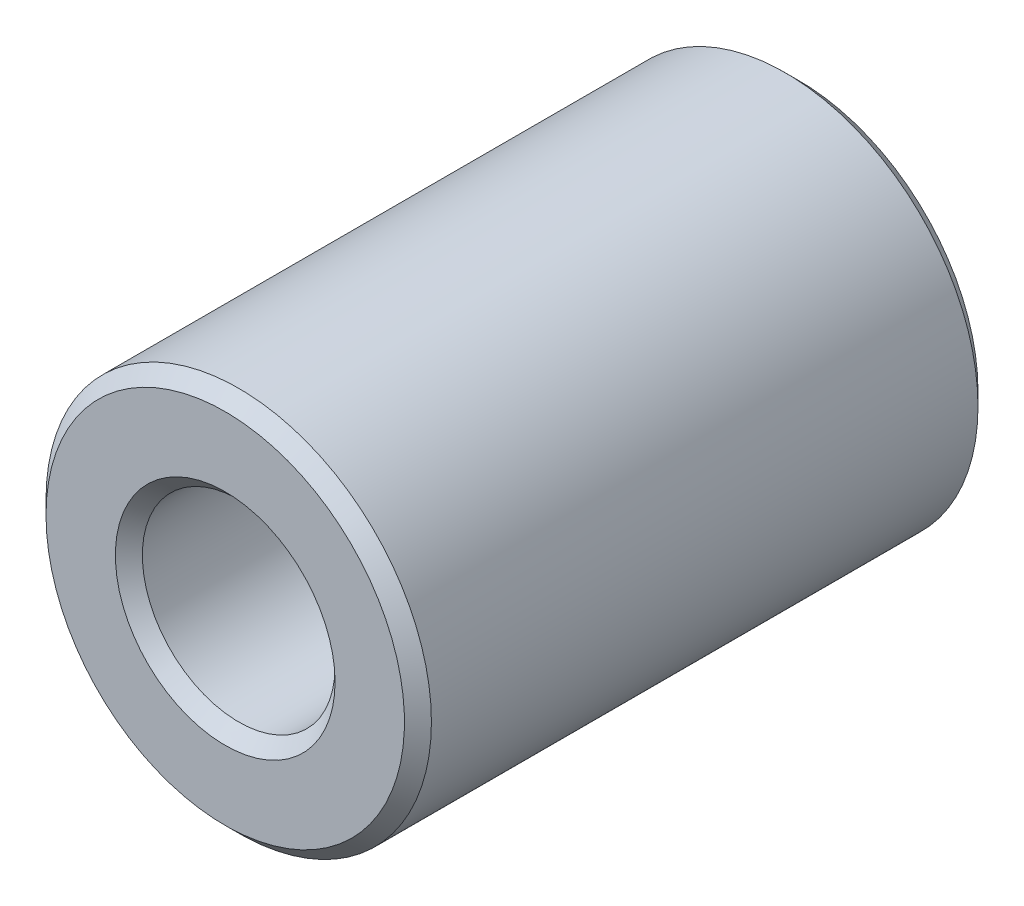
ISO-10303-21;
HEADER;
FILE_DESCRIPTION(('STEP AP214'),'2;1');
FILE_NAME('part.step','',(''),(''),'','','');
FILE_SCHEMA(('AUTOMOTIVE_DESIGN { 1 0 10303 214 1 1 1 1 }'));
ENDSEC;
DATA;
#1=APPLICATION_CONTEXT('core data for automotive mechanical design processes');
#2=APPLICATION_PROTOCOL_DEFINITION('international standard','automotive_design',2000,#1);
#3=PRODUCT_CONTEXT('',#1,'mechanical');
#4=PRODUCT('Part','Part','',(#3));
#5=PRODUCT_RELATED_PRODUCT_CATEGORY('part','',(#4));
#6=PRODUCT_DEFINITION_FORMATION('','',#4);
#7=PRODUCT_DEFINITION_CONTEXT('part definition',#1,'design');
#8=PRODUCT_DEFINITION('design','',#6,#7);
#9=PRODUCT_DEFINITION_SHAPE('','',#8);
#10=(LENGTH_UNIT() NAMED_UNIT(*) SI_UNIT(.MILLI.,.METRE.));
#11=(NAMED_UNIT(*) PLANE_ANGLE_UNIT() SI_UNIT($,.RADIAN.));
#12=(NAMED_UNIT(*) SI_UNIT($,.STERADIAN.) SOLID_ANGLE_UNIT());
#13=UNCERTAINTY_MEASURE_WITH_UNIT(LENGTH_MEASURE(1.E-05),#10,'distance_accuracy_value','');
#14=(GEOMETRIC_REPRESENTATION_CONTEXT(3) GLOBAL_UNCERTAINTY_ASSIGNED_CONTEXT((#13)) GLOBAL_UNIT_ASSIGNED_CONTEXT((#10,
#11,#12)) REPRESENTATION_CONTEXT('',''));
#15=CARTESIAN_POINT('',(0.,0.,0.));
#16=DIRECTION('',(0.,0.,1.));
#17=DIRECTION('',(1.,0.,0.));
#18=AXIS2_PLACEMENT_3D('',#15,#16,#17);
#19=CARTESIAN_POINT('',(0.,0.,-4.7625));
#20=DIRECTION('',(0.,0.,1.));
#21=DIRECTION('',(1.,0.,0.));
#22=AXIS2_PLACEMENT_3D('',#19,#20,#21);
#23=CYLINDRICAL_SURFACE('',#22,3.2004);
#24=CARTESIAN_POINT('',(0.,0.,-4.538472));
#25=DIRECTION('',(0.,0.,1.));
#26=DIRECTION('',(1.,0.,0.));
#27=AXIS2_PLACEMENT_3D('',#24,#25,#26);
#28=CIRCLE('',#27,3.2004);
#29=CARTESIAN_POINT('',(3.2004,0.,-4.538472));
#30=VERTEX_POINT('',#29);
#31=EDGE_CURVE('E78',#30,#30,#28,.T.);
#32=ORIENTED_EDGE('',*,*,#31,.T.);
#33=EDGE_LOOP('',(#32));
#34=FACE_BOUND('',#33,.T.);
#35=CARTESIAN_POINT('',(0.,0.,4.538472));
#36=DIRECTION('',(0.,0.,1.));
#37=DIRECTION('',(1.,0.,0.));
#38=AXIS2_PLACEMENT_3D('',#35,#36,#37);
#39=CIRCLE('',#38,3.2004);
#40=CARTESIAN_POINT('',(-3.2004,0.,4.538472));
#41=VERTEX_POINT('',#40);
#42=EDGE_CURVE('E82',#41,#41,#39,.F.);
#43=ORIENTED_EDGE('',*,*,#42,.T.);
#44=EDGE_LOOP('',(#43));
#45=FACE_BOUND('',#44,.T.);
#46=ADVANCED_FACE('F43',(#34,#45),#23,.T.);
#47=CARTESIAN_POINT('',(0.,0.,-4.7625));
#48=DIRECTION('',(0.,0.,1.));
#49=DIRECTION('',(1.,0.,0.));
#50=AXIS2_PLACEMENT_3D('',#47,#48,#49);
#51=PLANE('',#50);
#52=CARTESIAN_POINT('',(0.,0.,-4.7625));
#53=DIRECTION('',(0.,0.,1.));
#54=DIRECTION('',(1.,0.,0.));
#55=AXIS2_PLACEMENT_3D('',#52,#53,#54);
#56=CIRCLE('',#55,2.976372);
#57=CARTESIAN_POINT('',(2.976372,0.,-4.7625));
#58=VERTEX_POINT('',#57);
#59=EDGE_CURVE('E70',#58,#58,#56,.F.);
#60=ORIENTED_EDGE('',*,*,#59,.T.);
#61=EDGE_LOOP('',(#60));
#62=FACE_BOUND('',#61,.T.);
#63=CARTESIAN_POINT('',(0.,0.,-4.7625));
#64=DIRECTION('',(0.,0.,1.));
#65=DIRECTION('',(1.,0.,0.));
#66=AXIS2_PLACEMENT_3D('',#63,#64,#65);
#67=CIRCLE('',#66,1.824228);
#68=CARTESIAN_POINT('',(1.824228,0.,-4.7625));
#69=VERTEX_POINT('',#68);
#70=EDGE_CURVE('E74',#69,#69,#67,.T.);
#71=ORIENTED_EDGE('',*,*,#70,.T.);
#72=EDGE_LOOP('',(#71));
#73=FACE_BOUND('',#72,.T.);
#74=ADVANCED_FACE('F98',(#62,#73),#51,.F.);
#75=CARTESIAN_POINT('',(0.,0.,-4.7625));
#76=DIRECTION('',(0.,0.,1.));
#77=DIRECTION('',(1.,0.,0.));
#78=AXIS2_PLACEMENT_3D('',#75,#76,#77);
#79=CYLINDRICAL_SURFACE('',#78,1.6002);
#80=CARTESIAN_POINT('',(0.,0.,-4.538472));
#81=DIRECTION('',(0.,0.,1.));
#82=DIRECTION('',(1.,0.,0.));
#83=AXIS2_PLACEMENT_3D('',#80,#81,#82);
#84=CIRCLE('',#83,1.6002);
#85=CARTESIAN_POINT('',(1.6002,0.,-4.538472));
#86=VERTEX_POINT('',#85);
#87=EDGE_CURVE('E58',#86,#86,#84,.F.);
#88=ORIENTED_EDGE('',*,*,#87,.T.);
#89=EDGE_LOOP('',(#88));
#90=FACE_BOUND('',#89,.T.);
#91=CARTESIAN_POINT('',(0.,0.,4.538472));
#92=DIRECTION('',(0.,0.,1.));
#93=DIRECTION('',(1.,0.,0.));
#94=AXIS2_PLACEMENT_3D('',#91,#92,#93);
#95=CIRCLE('',#94,1.6002);
#96=CARTESIAN_POINT('',(1.6002,0.,4.538472));
#97=VERTEX_POINT('',#96);
#98=EDGE_CURVE('E64',#97,#97,#95,.T.);
#99=ORIENTED_EDGE('',*,*,#98,.T.);
#100=EDGE_LOOP('',(#99));
#101=FACE_BOUND('',#100,.T.);
#102=ADVANCED_FACE('F104',(#90,#101),#79,.F.);
#103=CARTESIAN_POINT('',(0.,0.,4.7625));
#104=DIRECTION('',(0.,0.,1.));
#105=DIRECTION('',(1.,0.,0.));
#106=AXIS2_PLACEMENT_3D('',#103,#104,#105);
#107=PLANE('',#106);
#108=CARTESIAN_POINT('',(0.,0.,4.7625));
#109=DIRECTION('',(0.,0.,1.));
#110=DIRECTION('',(1.,0.,0.));
#111=AXIS2_PLACEMENT_3D('',#108,#109,#110);
#112=CIRCLE('',#111,1.824228);
#113=CARTESIAN_POINT('',(1.824228,0.,4.7625));
#114=VERTEX_POINT('',#113);
#115=EDGE_CURVE('E10',#114,#114,#112,.F.);
#116=ORIENTED_EDGE('',*,*,#115,.T.);
#117=EDGE_LOOP('',(#116));
#118=FACE_BOUND('',#117,.T.);
#119=CARTESIAN_POINT('',(0.,0.,4.7625));
#120=DIRECTION('',(0.,0.,1.));
#121=DIRECTION('',(1.,0.,0.));
#122=AXIS2_PLACEMENT_3D('',#119,#120,#121);
#123=CIRCLE('',#122,2.976372);
#124=CARTESIAN_POINT('',(-2.976372,0.,4.7625));
#125=VERTEX_POINT('',#124);
#126=EDGE_CURVE('E52',#125,#125,#123,.T.);
#127=ORIENTED_EDGE('',*,*,#126,.T.);
#128=EDGE_LOOP('',(#127));
#129=FACE_BOUND('',#128,.T.);
#130=ADVANCED_FACE('F116',(#118,#129),#107,.T.);
#131=CARTESIAN_POINT('',(0.,0.,-4.538472));
#132=DIRECTION('',(0.,0.,1.));
#133=DIRECTION('',(1.,0.,0.));
#134=AXIS2_PLACEMENT_3D('',#131,#132,#133);
#135=CONICAL_SURFACE('',#134,3.2004,0.785398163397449);
#136=ORIENTED_EDGE('',*,*,#59,.F.);
#137=EDGE_LOOP('',(#136));
#138=FACE_BOUND('',#137,.T.);
#139=ORIENTED_EDGE('',*,*,#31,.F.);
#140=EDGE_LOOP('',(#139));
#141=FACE_BOUND('',#140,.T.);
#142=ADVANCED_FACE('F110',(#138,#141),#135,.T.);
#143=CARTESIAN_POINT('',(0.,0.,-4.7625));
#144=DIRECTION('',(0.,0.,-1.));
#145=DIRECTION('',(-1.,0.,0.));
#146=AXIS2_PLACEMENT_3D('',#143,#144,#145);
#147=CONICAL_SURFACE('',#146,1.824228,0.785398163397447);
#148=ORIENTED_EDGE('',*,*,#87,.F.);
#149=EDGE_LOOP('',(#148));
#150=FACE_BOUND('',#149,.T.);
#151=ORIENTED_EDGE('',*,*,#70,.F.);
#152=EDGE_LOOP('',(#151));
#153=FACE_BOUND('',#152,.T.);
#154=ADVANCED_FACE('F95',(#150,#153),#147,.F.);
#155=CARTESIAN_POINT('',(0.,0.,4.538472));
#156=DIRECTION('',(0.,0.,1.));
#157=DIRECTION('',(1.,0.,0.));
#158=AXIS2_PLACEMENT_3D('',#155,#156,#157);
#159=CONICAL_SURFACE('',#158,1.6002,0.785398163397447);
#160=CARTESIAN_POINT('',(1.824228,0.,4.7625));
#161=CARTESIAN_POINT('',(1.821894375,0.,4.760166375));
#162=CARTESIAN_POINT('',(1.81956075,0.,4.75783275));
#163=CARTESIAN_POINT('',(1.8148935,0.,4.7531655));
#164=CARTESIAN_POINT('',(1.812559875,0.,4.750831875));
#165=CARTESIAN_POINT('',(1.807892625,0.,4.746164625));
#166=CARTESIAN_POINT('',(1.805559,0.,4.743831));
#167=CARTESIAN_POINT('',(1.80089175,0.,4.73916375));
#168=CARTESIAN_POINT('',(1.798558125,0.,4.736830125));
#169=CARTESIAN_POINT('',(1.793890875,0.,4.732162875));
#170=CARTESIAN_POINT('',(1.79155725,0.,4.72982925));
#171=CARTESIAN_POINT('',(1.78689,0.,4.725162));
#172=CARTESIAN_POINT('',(1.784556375,0.,4.722828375));
#173=CARTESIAN_POINT('',(1.779889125,0.,4.718161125));
#174=CARTESIAN_POINT('',(1.7775555,0.,4.7158275));
#175=CARTESIAN_POINT('',(1.77288825,0.,4.71116025));
#176=CARTESIAN_POINT('',(1.770554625,0.,4.708826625));
#177=CARTESIAN_POINT('',(1.765887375,0.,4.704159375));
#178=CARTESIAN_POINT('',(1.76355375,0.,4.70182575));
#179=CARTESIAN_POINT('',(1.7588865,0.,4.6971585));
#180=CARTESIAN_POINT('',(1.756552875,0.,4.694824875));
#181=CARTESIAN_POINT('',(1.751885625,0.,4.690157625));
#182=CARTESIAN_POINT('',(1.749552,0.,4.687824));
#183=CARTESIAN_POINT('',(1.74488475,0.,4.68315675));
#184=CARTESIAN_POINT('',(1.742551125,0.,4.680823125));
#185=CARTESIAN_POINT('',(1.737883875,0.,4.676155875));
#186=CARTESIAN_POINT('',(1.73555025,0.,4.67382225));
#187=CARTESIAN_POINT('',(1.730883,0.,4.669155));
#188=CARTESIAN_POINT('',(1.728549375,0.,4.666821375));
#189=CARTESIAN_POINT('',(1.723882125,0.,4.662154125));
#190=CARTESIAN_POINT('',(1.7215485,0.,4.6598205));
#191=CARTESIAN_POINT('',(1.71688125,0.,4.65515325));
#192=CARTESIAN_POINT('',(1.714547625,0.,4.652819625));
#193=CARTESIAN_POINT('',(1.709880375,0.,4.648152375));
#194=CARTESIAN_POINT('',(1.70754675,0.,4.64581875));
#195=CARTESIAN_POINT('',(1.7028795,0.,4.6411515));
#196=CARTESIAN_POINT('',(1.700545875,0.,4.638817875));
#197=CARTESIAN_POINT('',(1.695878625,0.,4.634150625));
#198=CARTESIAN_POINT('',(1.693545,0.,4.631817));
#199=CARTESIAN_POINT('',(1.68887775,0.,4.62714975));
#200=CARTESIAN_POINT('',(1.686544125,0.,4.624816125));
#201=CARTESIAN_POINT('',(1.681876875,0.,4.620148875));
#202=CARTESIAN_POINT('',(1.67954325,0.,4.61781525));
#203=CARTESIAN_POINT('',(1.674876,0.,4.613148));
#204=CARTESIAN_POINT('',(1.672542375,0.,4.610814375));
#205=CARTESIAN_POINT('',(1.667875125,0.,4.606147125));
#206=CARTESIAN_POINT('',(1.6655415,0.,4.6038135));
#207=CARTESIAN_POINT('',(1.66087425,0.,4.59914625));
#208=CARTESIAN_POINT('',(1.658540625,0.,4.596812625));
#209=CARTESIAN_POINT('',(1.653873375,0.,4.592145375));
#210=CARTESIAN_POINT('',(1.65153975,0.,4.58981175));
#211=CARTESIAN_POINT('',(1.6468725,0.,4.5851445));
#212=CARTESIAN_POINT('',(1.644538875,0.,4.582810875));
#213=CARTESIAN_POINT('',(1.639871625,0.,4.578143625));
#214=CARTESIAN_POINT('',(1.637538,0.,4.57581));
#215=CARTESIAN_POINT('',(1.63287075,0.,4.57114275));
#216=CARTESIAN_POINT('',(1.630537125,0.,4.568809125));
#217=CARTESIAN_POINT('',(1.625869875,0.,4.564141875));
#218=CARTESIAN_POINT('',(1.62353625,0.,4.56180825));
#219=CARTESIAN_POINT('',(1.618869,0.,4.557141));
#220=CARTESIAN_POINT('',(1.616535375,0.,4.554807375));
#221=CARTESIAN_POINT('',(1.611868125,0.,4.550140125));
#222=CARTESIAN_POINT('',(1.6095345,0.,4.54780649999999));
#223=CARTESIAN_POINT('',(1.60486725,0.,4.54313924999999));
#224=CARTESIAN_POINT('',(1.602533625,0.,4.540805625));
#225=CARTESIAN_POINT('',(1.6002,0.,4.538472));
#226=B_SPLINE_CURVE_WITH_KNOTS('',3,(#160,#161,#162,#163,#164,#165,#166,#167,#168,#169,#170,
#171,#172,#173,#174,#175,#176,#177,#178,#179,#180,#181,#182,#183,#184,#185,#186,#187,#188,#189,
#190,#191,#192,#193,#194,#195,#196,#197,#198,#199,#200,#201,#202,#203,#204,#205,#206,#207,#208,
#209,#210,#211,#212,#213,#214,#215,#216,#217,#218,#219,#220,#221,#222,#223,#224,#225),
.UNSPECIFIED.,.F.,.F.,(4,2,2,2,2,2,2,2,2,2,2,2,2,2,2,2,2,2,2,2,2,2,2,2,2,2,2,2,2,2,2,2,4),(0.,
0.0099007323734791,0.0198014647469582,0.0297021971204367,0.0396029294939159,0.0495036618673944,
0.0594043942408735,0.069305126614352,0.0792058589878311,0.0891065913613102,0.0990073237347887,
0.108908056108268,0.118808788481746,0.128709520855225,0.138610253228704,0.148510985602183,
0.158411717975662,0.168312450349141,0.17821318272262,0.188113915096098,0.198014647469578,
0.207915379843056,0.217816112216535,0.227716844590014,0.237617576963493,0.247518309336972,
0.25741904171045,0.26731977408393,0.277220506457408,0.287121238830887,0.297021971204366,
0.306922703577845,0.316823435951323),.UNSPECIFIED.);
#227=EDGE_CURVE('BSEAM91',#114,#97,#226,.T.);
#228=ORIENTED_EDGE('',*,*,#115,.F.);
#229=ORIENTED_EDGE('',*,*,#98,.F.);
#230=ORIENTED_EDGE('',*,*,#227,.T.);
#231=ORIENTED_EDGE('',*,*,#227,.F.);
#232=EDGE_LOOP('',(#228,#230,#229,#231));
#233=FACE_BOUND('',#232,.T.);
#234=ADVANCED_FACE('F91',(#233),#159,.F.);
#235=CARTESIAN_POINT('',(0.,0.,4.7625));
#236=DIRECTION('',(0.,0.,-1.));
#237=DIRECTION('',(-1.,0.,0.));
#238=AXIS2_PLACEMENT_3D('',#235,#236,#237);
#239=CONICAL_SURFACE('',#238,2.976372,0.785398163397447);
#240=CARTESIAN_POINT('',(-3.2004,0.,4.538472));
#241=CARTESIAN_POINT('',(-3.198066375,0.,4.540805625));
#242=CARTESIAN_POINT('',(-3.19573275,0.,4.54313924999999));
#243=CARTESIAN_POINT('',(-3.1910655,0.,4.54780649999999));
#244=CARTESIAN_POINT('',(-3.188731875,0.,4.550140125));
#245=CARTESIAN_POINT('',(-3.184064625,0.,4.554807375));
#246=CARTESIAN_POINT('',(-3.181731,0.,4.557141));
#247=CARTESIAN_POINT('',(-3.17706375,0.,4.56180825));
#248=CARTESIAN_POINT('',(-3.174730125,0.,4.564141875));
#249=CARTESIAN_POINT('',(-3.170062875,0.,4.568809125));
#250=CARTESIAN_POINT('',(-3.16772925,0.,4.57114275));
#251=CARTESIAN_POINT('',(-3.163062,0.,4.57581));
#252=CARTESIAN_POINT('',(-3.160728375,0.,4.578143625));
#253=CARTESIAN_POINT('',(-3.156061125,0.,4.582810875));
#254=CARTESIAN_POINT('',(-3.1537275,0.,4.5851445));
#255=CARTESIAN_POINT('',(-3.14906025,0.,4.58981175));
#256=CARTESIAN_POINT('',(-3.146726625,0.,4.592145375));
#257=CARTESIAN_POINT('',(-3.142059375,0.,4.596812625));
#258=CARTESIAN_POINT('',(-3.13972575,0.,4.59914625));
#259=CARTESIAN_POINT('',(-3.1350585,0.,4.6038135));
#260=CARTESIAN_POINT('',(-3.132724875,0.,4.606147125));
#261=CARTESIAN_POINT('',(-3.128057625,0.,4.610814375));
#262=CARTESIAN_POINT('',(-3.125724,0.,4.613148));
#263=CARTESIAN_POINT('',(-3.12105675,0.,4.61781525));
#264=CARTESIAN_POINT('',(-3.118723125,0.,4.620148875));
#265=CARTESIAN_POINT('',(-3.114055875,0.,4.624816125));
#266=CARTESIAN_POINT('',(-3.11172225,0.,4.62714975));
#267=CARTESIAN_POINT('',(-3.107055,0.,4.631817));
#268=CARTESIAN_POINT('',(-3.104721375,0.,4.634150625));
#269=CARTESIAN_POINT('',(-3.100054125,0.,4.638817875));
#270=CARTESIAN_POINT('',(-3.0977205,0.,4.6411515));
#271=CARTESIAN_POINT('',(-3.09305325,0.,4.64581875));
#272=CARTESIAN_POINT('',(-3.090719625,0.,4.648152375));
#273=CARTESIAN_POINT('',(-3.086052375,0.,4.652819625));
#274=CARTESIAN_POINT('',(-3.08371875,0.,4.65515325));
#275=CARTESIAN_POINT('',(-3.0790515,0.,4.6598205));
#276=CARTESIAN_POINT('',(-3.076717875,0.,4.662154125));
#277=CARTESIAN_POINT('',(-3.072050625,0.,4.666821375));
#278=CARTESIAN_POINT('',(-3.069717,0.,4.669155));
#279=CARTESIAN_POINT('',(-3.06504975,0.,4.67382225));
#280=CARTESIAN_POINT('',(-3.062716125,0.,4.676155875));
#281=CARTESIAN_POINT('',(-3.058048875,0.,4.680823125));
#282=CARTESIAN_POINT('',(-3.05571525,0.,4.68315675));
#283=CARTESIAN_POINT('',(-3.051048,0.,4.687824));
#284=CARTESIAN_POINT('',(-3.048714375,0.,4.690157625));
#285=CARTESIAN_POINT('',(-3.044047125,0.,4.694824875));
#286=CARTESIAN_POINT('',(-3.0417135,0.,4.6971585));
#287=CARTESIAN_POINT('',(-3.03704625,0.,4.70182575));
#288=CARTESIAN_POINT('',(-3.034712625,0.,4.704159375));
#289=CARTESIAN_POINT('',(-3.030045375,0.,4.708826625));
#290=CARTESIAN_POINT('',(-3.02771175,0.,4.71116025));
#291=CARTESIAN_POINT('',(-3.0230445,0.,4.7158275));
#292=CARTESIAN_POINT('',(-3.020710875,0.,4.718161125));
#293=CARTESIAN_POINT('',(-3.016043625,0.,4.722828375));
#294=CARTESIAN_POINT('',(-3.01371,0.,4.725162));
#295=CARTESIAN_POINT('',(-3.00904275,0.,4.72982925));
#296=CARTESIAN_POINT('',(-3.006709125,0.,4.732162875));
#297=CARTESIAN_POINT('',(-3.002041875,0.,4.736830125));
#298=CARTESIAN_POINT('',(-2.99970825,0.,4.73916375));
#299=CARTESIAN_POINT('',(-2.995041,0.,4.743831));
#300=CARTESIAN_POINT('',(-2.992707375,0.,4.746164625));
#301=CARTESIAN_POINT('',(-2.988040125,0.,4.750831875));
#302=CARTESIAN_POINT('',(-2.9857065,0.,4.7531655));
#303=CARTESIAN_POINT('',(-2.98103925,0.,4.75783275));
#304=CARTESIAN_POINT('',(-2.978705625,0.,4.760166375));
#305=CARTESIAN_POINT('',(-2.976372,0.,4.7625));
#306=B_SPLINE_CURVE_WITH_KNOTS('',3,(#240,#241,#242,#243,#244,#245,#246,#247,#248,#249,#250,
#251,#252,#253,#254,#255,#256,#257,#258,#259,#260,#261,#262,#263,#264,#265,#266,#267,#268,#269,
#270,#271,#272,#273,#274,#275,#276,#277,#278,#279,#280,#281,#282,#283,#284,#285,#286,#287,#288,
#289,#290,#291,#292,#293,#294,#295,#296,#297,#298,#299,#300,#301,#302,#303,#304,#305),
.UNSPECIFIED.,.F.,.F.,(4,2,2,2,2,2,2,2,2,2,2,2,2,2,2,2,2,2,2,2,2,2,2,2,2,2,2,2,2,2,2,2,4),(0.,
0.00990073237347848,0.0198014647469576,0.0297021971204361,0.0396029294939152,0.0495036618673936,
0.059404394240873,0.0693051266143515,0.0792058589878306,0.0891065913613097,0.0990073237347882,
0.108908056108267,0.118808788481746,0.128709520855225,0.138610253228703,0.148510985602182,
0.158411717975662,0.16831245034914,0.178213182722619,0.188113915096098,0.198014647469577,
0.207915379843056,0.217816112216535,0.227716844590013,0.237617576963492,0.247518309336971,
0.25741904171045,0.267319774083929,0.277220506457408,0.287121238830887,0.297021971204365,
0.306922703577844,0.316823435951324),.UNSPECIFIED.);
#307=EDGE_CURVE('BSEAM46',#41,#125,#306,.T.);
#308=ORIENTED_EDGE('',*,*,#42,.F.);
#309=ORIENTED_EDGE('',*,*,#126,.F.);
#310=ORIENTED_EDGE('',*,*,#307,.T.);
#311=ORIENTED_EDGE('',*,*,#307,.F.);
#312=EDGE_LOOP('',(#308,#310,#309,#311));
#313=FACE_BOUND('',#312,.T.);
#314=ADVANCED_FACE('F46',(#313),#239,.T.);
#315=CLOSED_SHELL('',(#46,#74,#102,#130,#142,#154,#234,#314));
#316=MANIFOLD_SOLID_BREP('B2',#315);
#317=ADVANCED_BREP_SHAPE_REPRESENTATION('',(#18,#316),#14);
#318=SHAPE_DEFINITION_REPRESENTATION(#9,#317);
ENDSEC;
END-ISO-10303-21;
